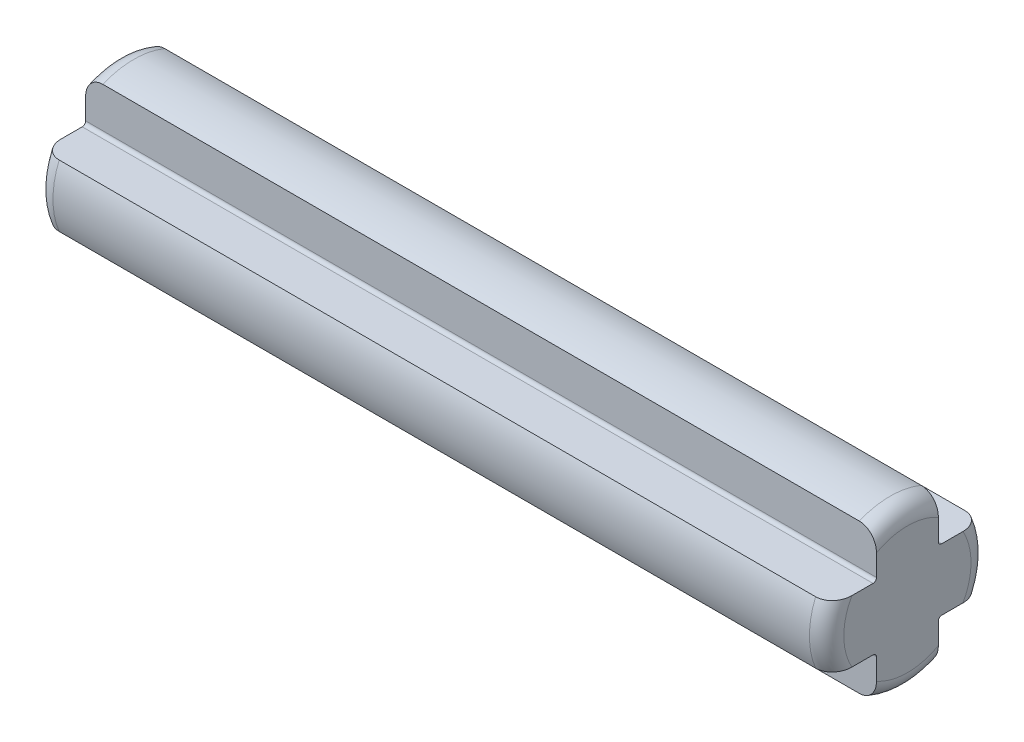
ISO-10303-21;
HEADER;
FILE_DESCRIPTION(('STEP AP214'),'2;1');
FILE_NAME('part.step','',(''),(''),'','','');
FILE_SCHEMA(('AUTOMOTIVE_DESIGN { 1 0 10303 214 1 1 1 1 }'));
ENDSEC;
DATA;
#1=APPLICATION_CONTEXT('core data for automotive mechanical design processes');
#2=APPLICATION_PROTOCOL_DEFINITION('international standard','automotive_design',2000,#1);
#3=PRODUCT_CONTEXT('',#1,'mechanical');
#4=PRODUCT('Part','Part','',(#3));
#5=PRODUCT_RELATED_PRODUCT_CATEGORY('part','',(#4));
#6=PRODUCT_DEFINITION_FORMATION('','',#4);
#7=PRODUCT_DEFINITION_CONTEXT('part definition',#1,'design');
#8=PRODUCT_DEFINITION('design','',#6,#7);
#9=PRODUCT_DEFINITION_SHAPE('','',#8);
#10=(LENGTH_UNIT() NAMED_UNIT(*) SI_UNIT(.MILLI.,.METRE.));
#11=(NAMED_UNIT(*) PLANE_ANGLE_UNIT() SI_UNIT($,.RADIAN.));
#12=(NAMED_UNIT(*) SI_UNIT($,.STERADIAN.) SOLID_ANGLE_UNIT());
#13=UNCERTAINTY_MEASURE_WITH_UNIT(LENGTH_MEASURE(1.E-05),#10,'distance_accuracy_value','');
#14=(GEOMETRIC_REPRESENTATION_CONTEXT(3) GLOBAL_UNCERTAINTY_ASSIGNED_CONTEXT((#13)) GLOBAL_UNIT_ASSIGNED_CONTEXT((#10,
#11,#12)) REPRESENTATION_CONTEXT('',''));
#15=CARTESIAN_POINT('',(0.,0.,0.));
#16=DIRECTION('',(0.,0.,1.));
#17=DIRECTION('',(1.,0.,0.));
#18=AXIS2_PLACEMENT_3D('',#15,#16,#17);
#19=CARTESIAN_POINT('',(11.5,0.,0.));
#20=DIRECTION('',(-1.,0.,0.));
#21=DIRECTION('',(0.,0.,1.));
#22=AXIS2_PLACEMENT_3D('',#19,#20,#21);
#23=CYLINDRICAL_SURFACE('',#22,2.35);
#24=DIRECTION('',(-1.,0.,0.));
#25=VECTOR('',#24,1.);
#26=CARTESIAN_POINT('',(11.5,0.9,2.17082933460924));
#27=LINE('',#26,#25);
#28=CARTESIAN_POINT('',(11.,0.9,2.17082933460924));
#29=VERTEX_POINT('',#28);
#30=CARTESIAN_POINT('',(-11.,0.9,2.17082933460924));
#31=VERTEX_POINT('',#30);
#32=EDGE_CURVE('E250',#29,#31,#27,.T.);
#33=ORIENTED_EDGE('',*,*,#32,.T.);
#34=CARTESIAN_POINT('',(-11.,0.,0.));
#35=DIRECTION('',(1.,0.,0.));
#36=DIRECTION('',(0.,0.,-1.));
#37=AXIS2_PLACEMENT_3D('',#34,#35,#36);
#38=CIRCLE('',#37,2.35);
#39=CARTESIAN_POINT('',(-11.,-0.900000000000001,2.17082933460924));
#40=VERTEX_POINT('',#39);
#41=EDGE_CURVE('E515',#31,#40,#38,.T.);
#42=ORIENTED_EDGE('',*,*,#41,.T.);
#43=DIRECTION('',(-1.,0.,0.));
#44=VECTOR('',#43,1.);
#45=CARTESIAN_POINT('',(11.5,-0.900000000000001,2.17082933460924));
#46=LINE('',#45,#44);
#47=CARTESIAN_POINT('',(11.,-0.900000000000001,2.17082933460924));
#48=VERTEX_POINT('',#47);
#49=EDGE_CURVE('E221',#48,#40,#46,.T.);
#50=ORIENTED_EDGE('',*,*,#49,.F.);
#51=CARTESIAN_POINT('',(11.,0.,0.));
#52=DIRECTION('',(1.,0.,0.));
#53=DIRECTION('',(0.,0.,-1.));
#54=AXIS2_PLACEMENT_3D('',#51,#52,#53);
#55=CIRCLE('',#54,2.35);
#56=EDGE_CURVE('E370',#48,#29,#55,.F.);
#57=ORIENTED_EDGE('',*,*,#56,.T.);
#58=EDGE_LOOP('',(#33,#42,#50,#57));
#59=FACE_BOUND('',#58,.T.);
#60=ADVANCED_FACE('F37',(#59),#23,.T.);
#61=CARTESIAN_POINT('',(11.5,-0.900000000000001,2.17082933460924));
#62=DIRECTION('',(0.,1.,0.));
#63=DIRECTION('',(0.,0.,1.));
#64=AXIS2_PLACEMENT_3D('',#61,#62,#63);
#65=PLANE('',#64);
#66=ORIENTED_EDGE('',*,*,#49,.T.);
#67=CARTESIAN_POINT('',(-11.,-0.900000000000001,2.17082933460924));
#68=CARTESIAN_POINT('',(-11.0264833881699,-0.900000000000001,2.17085986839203));
#69=CARTESIAN_POINT('',(-11.0529498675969,-0.900000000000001,2.16855372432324));
#70=CARTESIAN_POINT('',(-11.1050453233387,-0.900000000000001,2.15950506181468));
#71=CARTESIAN_POINT('',(-11.1306762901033,-0.900000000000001,2.15277404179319));
#72=CARTESIAN_POINT('',(-11.1804387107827,-0.900000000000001,2.1351114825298));
#73=CARTESIAN_POINT('',(-11.2045703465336,-0.900000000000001,2.12418045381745));
#74=CARTESIAN_POINT('',(-11.2507251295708,-0.900000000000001,2.09852306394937));
#75=CARTESIAN_POINT('',(-11.2727475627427,-0.900000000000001,2.0837954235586));
#76=CARTESIAN_POINT('',(-11.3147234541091,-0.900000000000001,2.05060839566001));
#77=CARTESIAN_POINT('',(-11.3346070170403,-0.900000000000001,2.03206082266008));
#78=CARTESIAN_POINT('',(-11.3712243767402,-0.900000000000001,1.99209288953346));
#79=CARTESIAN_POINT('',(-11.3879579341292,-0.900000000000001,1.97067231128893));
#80=CARTESIAN_POINT('',(-11.4190973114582,-0.900000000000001,1.92396602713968));
#81=CARTESIAN_POINT('',(-11.4332527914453,-0.900000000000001,1.89851375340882));
#82=CARTESIAN_POINT('',(-11.4575247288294,-0.900000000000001,1.84573102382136));
#83=CARTESIAN_POINT('',(-11.4676367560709,-0.900000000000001,1.81839854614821));
#84=CARTESIAN_POINT('',(-11.4838866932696,-0.900000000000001,1.76219756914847));
#85=CARTESIAN_POINT('',(-11.4899702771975,-0.900000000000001,1.73331353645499));
#86=CARTESIAN_POINT('',(-11.4980270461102,-0.900000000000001,1.67505065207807));
#87=CARTESIAN_POINT('',(-11.5000109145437,-0.900000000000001,1.64567328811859));
#88=CARTESIAN_POINT('',(-11.5,-0.900000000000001,1.61632298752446));
#89=B_SPLINE_CURVE_WITH_KNOTS('',3,(#67,#68,#69,#70,#71,#72,#73,#74,#75,#76,#77,#78,#79,#80,#81,
#82,#83,#84,#85,#86,#87,#88),.UNSPECIFIED.,.F.,.F.,(4,2,2,2,2,2,2,2,2,2,4),(0.,
0.0793238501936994,0.158442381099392,0.237551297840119,0.316686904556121,0.397909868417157,
0.479139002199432,0.566147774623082,0.653251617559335,0.741507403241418,0.829532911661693),.UNSPECIFIED.);
#90=CARTESIAN_POINT('',(-11.5,-0.900000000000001,1.61632298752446));
#91=VERTEX_POINT('',#90);
#92=EDGE_CURVE('E390',#40,#91,#89,.T.);
#93=ORIENTED_EDGE('',*,*,#92,.T.);
#94=DIRECTION('',(0.,0.,-1.));
#95=VECTOR('',#94,1.);
#96=CARTESIAN_POINT('',(-11.5,-0.900000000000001,2.17082933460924));
#97=LINE('',#96,#95);
#98=CARTESIAN_POINT('',(-11.5,-0.900000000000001,0.999999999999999));
#99=VERTEX_POINT('',#98);
#100=EDGE_CURVE('E218',#91,#99,#97,.T.);
#101=ORIENTED_EDGE('',*,*,#100,.T.);
#102=DIRECTION('',(-1.,0.,0.));
#103=VECTOR('',#102,1.);
#104=CARTESIAN_POINT('',(11.5,-0.900000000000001,0.999999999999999));
#105=LINE('',#104,#103);
#106=CARTESIAN_POINT('',(11.5,-0.900000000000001,0.999999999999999));
#107=VERTEX_POINT('',#106);
#108=EDGE_CURVE('E214',#107,#99,#105,.T.);
#109=ORIENTED_EDGE('',*,*,#108,.F.);
#110=DIRECTION('',(0.,0.,-1.));
#111=VECTOR('',#110,1.);
#112=CARTESIAN_POINT('',(11.5,-0.900000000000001,2.17082933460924));
#113=LINE('',#112,#111);
#114=CARTESIAN_POINT('',(11.5,-0.900000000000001,1.61632298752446));
#115=VERTEX_POINT('',#114);
#116=EDGE_CURVE('E201',#115,#107,#113,.T.);
#117=ORIENTED_EDGE('',*,*,#116,.F.);
#118=CARTESIAN_POINT('',(11.5,-0.900000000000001,1.61632298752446));
#119=CARTESIAN_POINT('',(11.5000222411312,-0.900000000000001,1.65066661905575));
#120=CARTESIAN_POINT('',(11.4972983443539,-0.900000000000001,1.68506058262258));
#121=CARTESIAN_POINT('',(11.4862156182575,-0.900000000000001,1.75308687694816));
#122=CARTESIAN_POINT('',(11.4778303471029,-0.900000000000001,1.78671486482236));
#123=CARTESIAN_POINT('',(11.4552419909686,-0.900000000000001,1.85211366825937));
#124=CARTESIAN_POINT('',(11.4410195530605,-0.900000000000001,1.88387790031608));
#125=CARTESIAN_POINT('',(11.4069131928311,-0.900000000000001,1.94414749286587));
#126=CARTESIAN_POINT('',(11.3870416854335,-0.900000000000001,1.97265980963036));
#127=CARTESIAN_POINT('',(11.344222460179,-0.900000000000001,2.02268935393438));
#128=CARTESIAN_POINT('',(11.3217526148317,-0.900000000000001,2.04461521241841));
#129=CARTESIAN_POINT('',(11.2730890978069,-0.900000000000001,2.08389547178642));
#130=CARTESIAN_POINT('',(11.2468952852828,-0.900000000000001,2.10124969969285));
#131=CARTESIAN_POINT('',(11.1943438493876,-0.900000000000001,2.12912089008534));
#132=CARTESIAN_POINT('',(11.1682509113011,-0.900000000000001,2.14013932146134));
#133=CARTESIAN_POINT('',(11.1145341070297,-0.900000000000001,2.15730052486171));
#134=CARTESIAN_POINT('',(11.086913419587,-0.900000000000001,2.1634530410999));
#135=CARTESIAN_POINT('',(11.0492135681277,-0.900000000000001,2.16830749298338));
#136=CARTESIAN_POINT('',(11.0393866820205,-0.900000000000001,2.1692533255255));
#137=CARTESIAN_POINT('',(11.0197081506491,-0.900000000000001,2.17051341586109));
#138=CARTESIAN_POINT('',(11.0098565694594,-0.900000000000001,2.17082867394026));
#139=CARTESIAN_POINT('',(11.,-0.900000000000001,2.17082933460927));
#140=B_SPLINE_CURVE_WITH_KNOTS('',3,(#118,#119,#120,#121,#122,#123,#124,#125,#126,#127,#128,
#129,#130,#131,#132,#133,#134,#135,#136,#137,#138,#139),.UNSPECIFIED.,.F.,.F.,(4,2,2,2,2,2,2,2,
2,2,4),(0.,0.103000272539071,0.206484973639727,0.310315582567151,0.413919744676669,
0.507586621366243,0.601257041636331,0.685799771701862,0.770172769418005,0.799774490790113,
0.829329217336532),.UNSPECIFIED.);
#141=EDGE_CURVE('E520',#115,#48,#140,.T.);
#142=ORIENTED_EDGE('',*,*,#141,.T.);
#143=EDGE_LOOP('',(#66,#93,#101,#109,#117,#142));
#144=FACE_BOUND('',#143,.T.);
#145=ADVANCED_FACE('F216',(#144),#65,.F.);
#146=CARTESIAN_POINT('',(11.5,-1.,0.999999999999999));
#147=DIRECTION('',(-1.,0.,0.));
#148=DIRECTION('',(0.,0.,1.));
#149=AXIS2_PLACEMENT_3D('',#146,#147,#148);
#150=CYLINDRICAL_SURFACE('',#149,0.0999999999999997);
#151=CARTESIAN_POINT('',(-11.5,-1.,0.999999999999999));
#152=DIRECTION('',(-1.,0.,0.));
#153=DIRECTION('',(0.,0.,1.));
#154=AXIS2_PLACEMENT_3D('',#151,#152,#153);
#155=CIRCLE('',#154,0.0999999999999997);
#156=CARTESIAN_POINT('',(-11.5,-1.,0.899999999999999));
#157=VERTEX_POINT('',#156);
#158=EDGE_CURVE('E252',#99,#157,#155,.T.);
#159=ORIENTED_EDGE('',*,*,#158,.T.);
#160=DIRECTION('',(-1.,0.,0.));
#161=VECTOR('',#160,1.);
#162=CARTESIAN_POINT('',(11.5,-1.,0.899999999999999));
#163=LINE('',#162,#161);
#164=CARTESIAN_POINT('',(11.5,-1.,0.899999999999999));
#165=VERTEX_POINT('',#164);
#166=EDGE_CURVE('E222',#165,#157,#163,.T.);
#167=ORIENTED_EDGE('',*,*,#166,.F.);
#168=CARTESIAN_POINT('',(11.5,-1.,0.999999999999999));
#169=DIRECTION('',(-1.,0.,0.));
#170=DIRECTION('',(0.,0.,1.));
#171=AXIS2_PLACEMENT_3D('',#168,#169,#170);
#172=CIRCLE('',#171,0.0999999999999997);
#173=EDGE_CURVE('E207',#107,#165,#172,.T.);
#174=ORIENTED_EDGE('',*,*,#173,.F.);
#175=ORIENTED_EDGE('',*,*,#108,.T.);
#176=EDGE_LOOP('',(#159,#167,#174,#175));
#177=FACE_BOUND('',#176,.T.);
#178=ADVANCED_FACE('F224',(#177),#150,.F.);
#179=CARTESIAN_POINT('',(11.5,-2.17082933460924,0.899999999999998));
#180=DIRECTION('',(0.,0.,-1.));
#181=DIRECTION('',(0.,1.,0.));
#182=AXIS2_PLACEMENT_3D('',#179,#180,#181);
#183=PLANE('',#182);
#184=DIRECTION('',(0.,-1.,0.));
#185=VECTOR('',#184,1.);
#186=CARTESIAN_POINT('',(-11.5,-2.17082933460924,0.899999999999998));
#187=LINE('',#186,#185);
#188=CARTESIAN_POINT('',(-11.5,-1.61632298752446,0.899999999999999));
#189=VERTEX_POINT('',#188);
#190=EDGE_CURVE('E254',#157,#189,#187,.T.);
#191=ORIENTED_EDGE('',*,*,#190,.T.);
#192=CARTESIAN_POINT('',(-11.5,-1.61632298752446,0.899999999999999));
#193=CARTESIAN_POINT('',(-11.5000222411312,-1.65066661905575,0.899999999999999));
#194=CARTESIAN_POINT('',(-11.4972983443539,-1.68506058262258,0.899999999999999));
#195=CARTESIAN_POINT('',(-11.4862156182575,-1.75308687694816,0.899999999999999));
#196=CARTESIAN_POINT('',(-11.4778303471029,-1.78671486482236,0.899999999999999));
#197=CARTESIAN_POINT('',(-11.4552419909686,-1.85211366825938,0.899999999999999));
#198=CARTESIAN_POINT('',(-11.4410195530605,-1.88387790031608,0.899999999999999));
#199=CARTESIAN_POINT('',(-11.4069131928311,-1.94414749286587,0.899999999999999));
#200=CARTESIAN_POINT('',(-11.3870416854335,-1.97265980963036,0.899999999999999));
#201=CARTESIAN_POINT('',(-11.344222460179,-2.02268935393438,0.899999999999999));
#202=CARTESIAN_POINT('',(-11.3217526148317,-2.04461521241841,0.899999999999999));
#203=CARTESIAN_POINT('',(-11.2730890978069,-2.08389547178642,0.899999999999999));
#204=CARTESIAN_POINT('',(-11.2468952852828,-2.10124969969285,0.899999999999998));
#205=CARTESIAN_POINT('',(-11.1943438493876,-2.12912089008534,0.899999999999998));
#206=CARTESIAN_POINT('',(-11.1682509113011,-2.14013932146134,0.899999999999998));
#207=CARTESIAN_POINT('',(-11.1145341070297,-2.15730052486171,0.899999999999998));
#208=CARTESIAN_POINT('',(-11.086913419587,-2.1634530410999,0.899999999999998));
#209=CARTESIAN_POINT('',(-11.0492135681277,-2.16830749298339,0.899999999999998));
#210=CARTESIAN_POINT('',(-11.0393866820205,-2.1692533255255,0.899999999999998));
#211=CARTESIAN_POINT('',(-11.0197081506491,-2.17051341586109,0.899999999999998));
#212=CARTESIAN_POINT('',(-11.0098565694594,-2.17082867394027,0.899999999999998));
#213=CARTESIAN_POINT('',(-11.,-2.17082933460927,0.899999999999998));
#214=B_SPLINE_CURVE_WITH_KNOTS('',3,(#192,#193,#194,#195,#196,#197,#198,#199,#200,#201,#202,
#203,#204,#205,#206,#207,#208,#209,#210,#211,#212,#213),.UNSPECIFIED.,.F.,.F.,(4,2,2,2,2,2,2,2,
2,2,4),(0.,0.103000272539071,0.206484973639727,0.310315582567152,0.413919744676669,
0.507586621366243,0.60125704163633,0.68579977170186,0.770172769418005,0.799774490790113,
0.829329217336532),.UNSPECIFIED.);
#215=CARTESIAN_POINT('',(-11.,-2.17082933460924,0.899999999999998));
#216=VERTEX_POINT('',#215);
#217=EDGE_CURVE('E365',#189,#216,#214,.T.);
#218=ORIENTED_EDGE('',*,*,#217,.T.);
#219=DIRECTION('',(-1.,0.,0.));
#220=VECTOR('',#219,1.);
#221=CARTESIAN_POINT('',(11.5,-2.17082933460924,0.899999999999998));
#222=LINE('',#221,#220);
#223=CARTESIAN_POINT('',(11.,-2.17082933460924,0.899999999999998));
#224=VERTEX_POINT('',#223);
#225=EDGE_CURVE('E312',#224,#216,#222,.T.);
#226=ORIENTED_EDGE('',*,*,#225,.F.);
#227=CARTESIAN_POINT('',(11.,-2.17082933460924,0.899999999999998));
#228=CARTESIAN_POINT('',(11.0264833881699,-2.17085986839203,0.899999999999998));
#229=CARTESIAN_POINT('',(11.0529498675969,-2.16855372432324,0.899999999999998));
#230=CARTESIAN_POINT('',(11.1050453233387,-2.15950506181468,0.899999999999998));
#231=CARTESIAN_POINT('',(11.1306762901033,-2.15277404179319,0.899999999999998));
#232=CARTESIAN_POINT('',(11.1804387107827,-2.1351114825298,0.899999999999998));
#233=CARTESIAN_POINT('',(11.2045703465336,-2.12418045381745,0.899999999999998));
#234=CARTESIAN_POINT('',(11.2507251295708,-2.09852306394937,0.899999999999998));
#235=CARTESIAN_POINT('',(11.2727475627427,-2.0837954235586,0.899999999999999));
#236=CARTESIAN_POINT('',(11.3147234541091,-2.05060839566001,0.899999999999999));
#237=CARTESIAN_POINT('',(11.3346070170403,-2.03206082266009,0.899999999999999));
#238=CARTESIAN_POINT('',(11.3712243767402,-1.99209288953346,0.899999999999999));
#239=CARTESIAN_POINT('',(11.3879579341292,-1.97067231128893,0.899999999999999));
#240=CARTESIAN_POINT('',(11.4190973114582,-1.92396602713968,0.899999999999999));
#241=CARTESIAN_POINT('',(11.4332527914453,-1.89851375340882,0.899999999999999));
#242=CARTESIAN_POINT('',(11.4575247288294,-1.84573102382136,0.899999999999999));
#243=CARTESIAN_POINT('',(11.4676367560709,-1.81839854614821,0.899999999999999));
#244=CARTESIAN_POINT('',(11.4838866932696,-1.76219756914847,0.899999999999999));
#245=CARTESIAN_POINT('',(11.4899702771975,-1.733313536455,0.899999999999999));
#246=CARTESIAN_POINT('',(11.4980270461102,-1.67505065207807,0.899999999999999));
#247=CARTESIAN_POINT('',(11.5000109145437,-1.64567328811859,0.899999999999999));
#248=CARTESIAN_POINT('',(11.5,-1.61632298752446,0.899999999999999));
#249=B_SPLINE_CURVE_WITH_KNOTS('',3,(#227,#228,#229,#230,#231,#232,#233,#234,#235,#236,#237,
#238,#239,#240,#241,#242,#243,#244,#245,#246,#247,#248),.UNSPECIFIED.,.F.,.F.,(4,2,2,2,2,2,2,2,
2,2,4),(0.,0.0793238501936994,0.158442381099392,0.237551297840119,0.316686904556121,
0.397909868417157,0.479139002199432,0.566147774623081,0.653251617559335,0.741507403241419,
0.829532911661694),.UNSPECIFIED.);
#250=CARTESIAN_POINT('',(11.5,-1.61632298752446,0.899999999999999));
#251=VERTEX_POINT('',#250);
#252=EDGE_CURVE('E359',#224,#251,#249,.T.);
#253=ORIENTED_EDGE('',*,*,#252,.T.);
#254=DIRECTION('',(0.,-1.,0.));
#255=VECTOR('',#254,1.);
#256=CARTESIAN_POINT('',(11.5,-2.17082933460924,0.899999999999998));
#257=LINE('',#256,#255);
#258=EDGE_CURVE('E227',#165,#251,#257,.T.);
#259=ORIENTED_EDGE('',*,*,#258,.F.);
#260=ORIENTED_EDGE('',*,*,#166,.T.);
#261=EDGE_LOOP('',(#191,#218,#226,#253,#259,#260));
#262=FACE_BOUND('',#261,.T.);
#263=ADVANCED_FACE('F350',(#262),#183,.F.);
#264=CARTESIAN_POINT('',(11.5,0.,0.));
#265=DIRECTION('',(-1.,0.,0.));
#266=DIRECTION('',(0.,0.,1.));
#267=AXIS2_PLACEMENT_3D('',#264,#265,#266);
#268=CYLINDRICAL_SURFACE('',#267,2.35);
#269=ORIENTED_EDGE('',*,*,#225,.T.);
#270=CARTESIAN_POINT('',(-11.,0.,0.));
#271=DIRECTION('',(1.,0.,0.));
#272=DIRECTION('',(0.,0.,-1.));
#273=AXIS2_PLACEMENT_3D('',#270,#271,#272);
#274=CIRCLE('',#273,2.35);
#275=CARTESIAN_POINT('',(-11.,-2.17082933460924,-0.9));
#276=VERTEX_POINT('',#275);
#277=EDGE_CURVE('E319',#216,#276,#274,.T.);
#278=ORIENTED_EDGE('',*,*,#277,.T.);
#279=DIRECTION('',(-1.,0.,0.));
#280=VECTOR('',#279,1.);
#281=CARTESIAN_POINT('',(11.5,-2.17082933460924,-0.9));
#282=LINE('',#281,#280);
#283=CARTESIAN_POINT('',(11.,-2.17082933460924,-0.9));
#284=VERTEX_POINT('',#283);
#285=EDGE_CURVE('E309',#284,#276,#282,.T.);
#286=ORIENTED_EDGE('',*,*,#285,.F.);
#287=CARTESIAN_POINT('',(11.,0.,0.));
#288=DIRECTION('',(1.,0.,0.));
#289=DIRECTION('',(0.,0.,-1.));
#290=AXIS2_PLACEMENT_3D('',#287,#288,#289);
#291=CIRCLE('',#290,2.35);
#292=EDGE_CURVE('E317',#284,#224,#291,.F.);
#293=ORIENTED_EDGE('',*,*,#292,.T.);
#294=EDGE_LOOP('',(#269,#278,#286,#293));
#295=FACE_BOUND('',#294,.T.);
#296=ADVANCED_FACE('F344',(#295),#268,.T.);
#297=CARTESIAN_POINT('',(11.5,-2.17082933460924,-0.9));
#298=DIRECTION('',(0.,0.,1.));
#299=DIRECTION('',(0.,-1.,0.));
#300=AXIS2_PLACEMENT_3D('',#297,#298,#299);
#301=PLANE('',#300);
#302=ORIENTED_EDGE('',*,*,#285,.T.);
#303=CARTESIAN_POINT('',(-11.,-2.17082933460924,-0.9));
#304=CARTESIAN_POINT('',(-11.0264833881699,-2.17085986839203,-0.9));
#305=CARTESIAN_POINT('',(-11.0529498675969,-2.16855372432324,-0.9));
#306=CARTESIAN_POINT('',(-11.1050453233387,-2.15950506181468,-0.9));
#307=CARTESIAN_POINT('',(-11.1306762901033,-2.15277404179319,-0.9));
#308=CARTESIAN_POINT('',(-11.1804387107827,-2.1351114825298,-0.9));
#309=CARTESIAN_POINT('',(-11.2045703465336,-2.12418045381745,-0.9));
#310=CARTESIAN_POINT('',(-11.2507251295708,-2.09852306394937,-0.9));
#311=CARTESIAN_POINT('',(-11.2727475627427,-2.0837954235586,-0.9));
#312=CARTESIAN_POINT('',(-11.3147234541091,-2.05060839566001,-0.9));
#313=CARTESIAN_POINT('',(-11.3346070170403,-2.03206082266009,-0.9));
#314=CARTESIAN_POINT('',(-11.3712243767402,-1.99209288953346,-0.9));
#315=CARTESIAN_POINT('',(-11.3879579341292,-1.97067231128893,-0.9));
#316=CARTESIAN_POINT('',(-11.4190973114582,-1.92396602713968,-0.9));
#317=CARTESIAN_POINT('',(-11.4332527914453,-1.89851375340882,-0.9));
#318=CARTESIAN_POINT('',(-11.4575247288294,-1.84573102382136,-0.9));
#319=CARTESIAN_POINT('',(-11.4676367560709,-1.81839854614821,-0.9));
#320=CARTESIAN_POINT('',(-11.4838866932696,-1.76219756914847,-0.9));
#321=CARTESIAN_POINT('',(-11.4899702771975,-1.733313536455,-0.9));
#322=CARTESIAN_POINT('',(-11.4980270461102,-1.67505065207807,-0.9));
#323=CARTESIAN_POINT('',(-11.5000109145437,-1.64567328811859,-0.9));
#324=CARTESIAN_POINT('',(-11.5,-1.61632298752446,-0.9));
#325=B_SPLINE_CURVE_WITH_KNOTS('',3,(#303,#304,#305,#306,#307,#308,#309,#310,#311,#312,#313,
#314,#315,#316,#317,#318,#319,#320,#321,#322,#323,#324),.UNSPECIFIED.,.F.,.F.,(4,2,2,2,2,2,2,2,
2,2,4),(0.,0.0793238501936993,0.158442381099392,0.237551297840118,0.316686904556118,
0.397909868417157,0.479139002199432,0.566147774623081,0.653251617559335,0.741507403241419,
0.829532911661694),.UNSPECIFIED.);
#326=CARTESIAN_POINT('',(-11.5,-1.61632298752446,-0.9));
#327=VERTEX_POINT('',#326);
#328=EDGE_CURVE('E329',#276,#327,#325,.T.);
#329=ORIENTED_EDGE('',*,*,#328,.T.);
#330=DIRECTION('',(0.,1.,0.));
#331=VECTOR('',#330,1.);
#332=CARTESIAN_POINT('',(-11.5,-2.17082933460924,-0.9));
#333=LINE('',#332,#331);
#334=CARTESIAN_POINT('',(-11.5,-1.,-0.9));
#335=VERTEX_POINT('',#334);
#336=EDGE_CURVE('E257',#327,#335,#333,.T.);
#337=ORIENTED_EDGE('',*,*,#336,.T.);
#338=DIRECTION('',(-1.,0.,0.));
#339=VECTOR('',#338,1.);
#340=CARTESIAN_POINT('',(11.5,-1.,-0.9));
#341=LINE('',#340,#339);
#342=CARTESIAN_POINT('',(11.5,-1.,-0.9));
#343=VERTEX_POINT('',#342);
#344=EDGE_CURVE('E306',#343,#335,#341,.T.);
#345=ORIENTED_EDGE('',*,*,#344,.F.);
#346=DIRECTION('',(0.,1.,0.));
#347=VECTOR('',#346,1.);
#348=CARTESIAN_POINT('',(11.5,-2.17082933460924,-0.9));
#349=LINE('',#348,#347);
#350=CARTESIAN_POINT('',(11.5,-1.61632298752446,-0.9));
#351=VERTEX_POINT('',#350);
#352=EDGE_CURVE('E229',#351,#343,#349,.T.);
#353=ORIENTED_EDGE('',*,*,#352,.F.);
#354=CARTESIAN_POINT('',(11.5,-1.61632298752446,-0.9));
#355=CARTESIAN_POINT('',(11.5000222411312,-1.65066661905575,-0.9));
#356=CARTESIAN_POINT('',(11.4972983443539,-1.68506058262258,-0.9));
#357=CARTESIAN_POINT('',(11.4862156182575,-1.75308687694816,-0.9));
#358=CARTESIAN_POINT('',(11.4778303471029,-1.78671486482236,-0.9));
#359=CARTESIAN_POINT('',(11.4552419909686,-1.85211366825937,-0.9));
#360=CARTESIAN_POINT('',(11.4410195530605,-1.88387790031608,-0.9));
#361=CARTESIAN_POINT('',(11.4069131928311,-1.94414749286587,-0.9));
#362=CARTESIAN_POINT('',(11.3870416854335,-1.97265980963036,-0.9));
#363=CARTESIAN_POINT('',(11.344222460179,-2.02268935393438,-0.9));
#364=CARTESIAN_POINT('',(11.3217526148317,-2.04461521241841,-0.9));
#365=CARTESIAN_POINT('',(11.2730890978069,-2.08389547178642,-0.9));
#366=CARTESIAN_POINT('',(11.2468952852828,-2.10124969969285,-0.9));
#367=CARTESIAN_POINT('',(11.1943438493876,-2.12912089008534,-0.9));
#368=CARTESIAN_POINT('',(11.1682509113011,-2.14013932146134,-0.9));
#369=CARTESIAN_POINT('',(11.1145341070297,-2.15730052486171,-0.9));
#370=CARTESIAN_POINT('',(11.086913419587,-2.1634530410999,-0.9));
#371=CARTESIAN_POINT('',(11.0492135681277,-2.16830749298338,-0.9));
#372=CARTESIAN_POINT('',(11.0393866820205,-2.1692533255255,-0.9));
#373=CARTESIAN_POINT('',(11.0197081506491,-2.17051341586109,-0.9));
#374=CARTESIAN_POINT('',(11.0098565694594,-2.17082867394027,-0.9));
#375=CARTESIAN_POINT('',(11.,-2.17082933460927,-0.9));
#376=B_SPLINE_CURVE_WITH_KNOTS('',3,(#354,#355,#356,#357,#358,#359,#360,#361,#362,#363,#364,
#365,#366,#367,#368,#369,#370,#371,#372,#373,#374,#375),.UNSPECIFIED.,.F.,.F.,(4,2,2,2,2,2,2,2,
2,2,4),(0.,0.103000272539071,0.206484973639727,0.310315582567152,0.413919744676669,
0.507586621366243,0.601257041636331,0.685799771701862,0.770172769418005,0.799774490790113,
0.829329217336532),.UNSPECIFIED.);
#377=EDGE_CURVE('E322',#351,#284,#376,.T.);
#378=ORIENTED_EDGE('',*,*,#377,.T.);
#379=EDGE_LOOP('',(#302,#329,#337,#345,#353,#378));
#380=FACE_BOUND('',#379,.T.);
#381=ADVANCED_FACE('F338',(#380),#301,.F.);
#382=CARTESIAN_POINT('',(11.5,-1.,-1.));
#383=DIRECTION('',(-1.,0.,0.));
#384=DIRECTION('',(0.,0.,1.));
#385=AXIS2_PLACEMENT_3D('',#382,#383,#384);
#386=CYLINDRICAL_SURFACE('',#385,0.0999999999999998);
#387=CARTESIAN_POINT('',(-11.5,-1.,-1.));
#388=DIRECTION('',(-1.,0.,0.));
#389=DIRECTION('',(0.,0.,-1.));
#390=AXIS2_PLACEMENT_3D('',#387,#388,#389);
#391=CIRCLE('',#390,0.0999999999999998);
#392=CARTESIAN_POINT('',(-11.5,-0.9,-1.));
#393=VERTEX_POINT('',#392);
#394=EDGE_CURVE('E259',#335,#393,#391,.T.);
#395=ORIENTED_EDGE('',*,*,#394,.T.);
#396=DIRECTION('',(-1.,0.,0.));
#397=VECTOR('',#396,1.);
#398=CARTESIAN_POINT('',(11.5,-0.9,-1.));
#399=LINE('',#398,#397);
#400=CARTESIAN_POINT('',(11.5,-0.9,-1.));
#401=VERTEX_POINT('',#400);
#402=EDGE_CURVE('E303',#401,#393,#399,.T.);
#403=ORIENTED_EDGE('',*,*,#402,.F.);
#404=CARTESIAN_POINT('',(11.5,-1.,-1.));
#405=DIRECTION('',(-1.,0.,0.));
#406=DIRECTION('',(0.,0.,-1.));
#407=AXIS2_PLACEMENT_3D('',#404,#405,#406);
#408=CIRCLE('',#407,0.0999999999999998);
#409=EDGE_CURVE('E233',#343,#401,#408,.T.);
#410=ORIENTED_EDGE('',*,*,#409,.F.);
#411=ORIENTED_EDGE('',*,*,#344,.T.);
#412=EDGE_LOOP('',(#395,#403,#410,#411));
#413=FACE_BOUND('',#412,.T.);
#414=ADVANCED_FACE('F343',(#413),#386,.F.);
#415=CARTESIAN_POINT('',(11.5,-0.900000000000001,-2.17082933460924));
#416=DIRECTION('',(0.,1.,0.));
#417=DIRECTION('',(0.,0.,1.));
#418=AXIS2_PLACEMENT_3D('',#415,#416,#417);
#419=PLANE('',#418);
#420=DIRECTION('',(0.,0.,-1.));
#421=VECTOR('',#420,1.);
#422=CARTESIAN_POINT('',(-11.5,-0.900000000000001,-2.17082933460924));
#423=LINE('',#422,#421);
#424=CARTESIAN_POINT('',(-11.5,-0.9,-1.61632298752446));
#425=VERTEX_POINT('',#424);
#426=EDGE_CURVE('E261',#393,#425,#423,.T.);
#427=ORIENTED_EDGE('',*,*,#426,.T.);
#428=CARTESIAN_POINT('',(-11.5,-0.9,-1.61632298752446));
#429=CARTESIAN_POINT('',(-11.5000222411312,-0.9,-1.65066661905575));
#430=CARTESIAN_POINT('',(-11.4972983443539,-0.9,-1.68506058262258));
#431=CARTESIAN_POINT('',(-11.4862156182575,-0.9,-1.75308687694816));
#432=CARTESIAN_POINT('',(-11.4778303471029,-0.9,-1.78671486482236));
#433=CARTESIAN_POINT('',(-11.4552419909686,-0.9,-1.85211366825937));
#434=CARTESIAN_POINT('',(-11.4410195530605,-0.9,-1.88387790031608));
#435=CARTESIAN_POINT('',(-11.4069131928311,-0.9,-1.94414749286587));
#436=CARTESIAN_POINT('',(-11.3870416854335,-0.9,-1.97265980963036));
#437=CARTESIAN_POINT('',(-11.344222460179,-0.9,-2.02268935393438));
#438=CARTESIAN_POINT('',(-11.3217526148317,-0.900000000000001,-2.04461521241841));
#439=CARTESIAN_POINT('',(-11.2730890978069,-0.900000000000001,-2.08389547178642));
#440=CARTESIAN_POINT('',(-11.2468952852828,-0.900000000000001,-2.10124969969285));
#441=CARTESIAN_POINT('',(-11.1943438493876,-0.900000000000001,-2.12912089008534));
#442=CARTESIAN_POINT('',(-11.1682509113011,-0.900000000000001,-2.14013932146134));
#443=CARTESIAN_POINT('',(-11.1145341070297,-0.900000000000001,-2.15730052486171));
#444=CARTESIAN_POINT('',(-11.086913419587,-0.900000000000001,-2.1634530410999));
#445=CARTESIAN_POINT('',(-11.0492135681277,-0.900000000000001,-2.16830749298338));
#446=CARTESIAN_POINT('',(-11.0393866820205,-0.900000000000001,-2.1692533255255));
#447=CARTESIAN_POINT('',(-11.0197081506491,-0.900000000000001,-2.17051341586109));
#448=CARTESIAN_POINT('',(-11.0098565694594,-0.900000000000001,-2.17082867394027));
#449=CARTESIAN_POINT('',(-11.,-0.900000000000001,-2.17082933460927));
#450=B_SPLINE_CURVE_WITH_KNOTS('',3,(#428,#429,#430,#431,#432,#433,#434,#435,#436,#437,#438,
#439,#440,#441,#442,#443,#444,#445,#446,#447,#448,#449),.UNSPECIFIED.,.F.,.F.,(4,2,2,2,2,2,2,2,
2,2,4),(0.,0.103000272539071,0.206484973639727,0.310315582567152,0.413919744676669,
0.507586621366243,0.601257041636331,0.685799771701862,0.770172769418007,0.799774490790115,
0.829329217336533),.UNSPECIFIED.);
#451=CARTESIAN_POINT('',(-11.,-0.9,-2.17082933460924));
#452=VERTEX_POINT('',#451);
#453=EDGE_CURVE('E489',#425,#452,#450,.T.);
#454=ORIENTED_EDGE('',*,*,#453,.T.);
#455=DIRECTION('',(-1.,0.,0.));
#456=VECTOR('',#455,1.);
#457=CARTESIAN_POINT('',(11.5,-0.9,-2.17082933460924));
#458=LINE('',#457,#456);
#459=CARTESIAN_POINT('',(11.,-0.9,-2.17082933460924));
#460=VERTEX_POINT('',#459);
#461=EDGE_CURVE('E300',#460,#452,#458,.T.);
#462=ORIENTED_EDGE('',*,*,#461,.F.);
#463=CARTESIAN_POINT('',(11.,-0.9,-2.17082933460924));
#464=CARTESIAN_POINT('',(11.0264833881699,-0.9,-2.17085986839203));
#465=CARTESIAN_POINT('',(11.0529498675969,-0.900000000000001,-2.16855372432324));
#466=CARTESIAN_POINT('',(11.1050453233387,-0.900000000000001,-2.15950506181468));
#467=CARTESIAN_POINT('',(11.1306762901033,-0.900000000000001,-2.15277404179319));
#468=CARTESIAN_POINT('',(11.1804387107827,-0.900000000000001,-2.1351114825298));
#469=CARTESIAN_POINT('',(11.2045703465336,-0.900000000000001,-2.12418045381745));
#470=CARTESIAN_POINT('',(11.2507251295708,-0.900000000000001,-2.09852306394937));
#471=CARTESIAN_POINT('',(11.2727475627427,-0.900000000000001,-2.0837954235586));
#472=CARTESIAN_POINT('',(11.3147234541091,-0.900000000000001,-2.05060839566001));
#473=CARTESIAN_POINT('',(11.3346070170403,-0.9,-2.03206082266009));
#474=CARTESIAN_POINT('',(11.3712243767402,-0.9,-1.99209288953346));
#475=CARTESIAN_POINT('',(11.3879579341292,-0.9,-1.97067231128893));
#476=CARTESIAN_POINT('',(11.4190973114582,-0.9,-1.92396602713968));
#477=CARTESIAN_POINT('',(11.4332527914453,-0.9,-1.89851375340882));
#478=CARTESIAN_POINT('',(11.4575247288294,-0.9,-1.84573102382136));
#479=CARTESIAN_POINT('',(11.4676367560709,-0.9,-1.81839854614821));
#480=CARTESIAN_POINT('',(11.4838866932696,-0.9,-1.76219756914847));
#481=CARTESIAN_POINT('',(11.4899702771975,-0.9,-1.733313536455));
#482=CARTESIAN_POINT('',(11.4980270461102,-0.9,-1.67505065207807));
#483=CARTESIAN_POINT('',(11.5000109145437,-0.9,-1.64567328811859));
#484=CARTESIAN_POINT('',(11.5,-0.9,-1.61632298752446));
#485=B_SPLINE_CURVE_WITH_KNOTS('',3,(#463,#464,#465,#466,#467,#468,#469,#470,#471,#472,#473,
#474,#475,#476,#477,#478,#479,#480,#481,#482,#483,#484),.UNSPECIFIED.,.F.,.F.,(4,2,2,2,2,2,2,2,
2,2,4),(0.,0.0793238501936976,0.158442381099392,0.237551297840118,0.316686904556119,
0.397909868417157,0.479139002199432,0.566147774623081,0.653251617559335,0.741507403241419,
0.829532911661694),.UNSPECIFIED.);
#486=CARTESIAN_POINT('',(11.5,-0.9,-1.61632298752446));
#487=VERTEX_POINT('',#486);
#488=EDGE_CURVE('E53',#460,#487,#485,.T.);
#489=ORIENTED_EDGE('',*,*,#488,.T.);
#490=DIRECTION('',(0.,0.,-1.));
#491=VECTOR('',#490,1.);
#492=CARTESIAN_POINT('',(11.5,-0.900000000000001,-2.17082933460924));
#493=LINE('',#492,#491);
#494=EDGE_CURVE('E235',#401,#487,#493,.T.);
#495=ORIENTED_EDGE('',*,*,#494,.F.);
#496=ORIENTED_EDGE('',*,*,#402,.T.);
#497=EDGE_LOOP('',(#427,#454,#462,#489,#495,#496));
#498=FACE_BOUND('',#497,.T.);
#499=ADVANCED_FACE('F496',(#498),#419,.F.);
#500=CARTESIAN_POINT('',(11.5,0.,0.));
#501=DIRECTION('',(-1.,0.,0.));
#502=DIRECTION('',(0.,0.,1.));
#503=AXIS2_PLACEMENT_3D('',#500,#501,#502);
#504=CYLINDRICAL_SURFACE('',#503,2.35);
#505=ORIENTED_EDGE('',*,*,#461,.T.);
#506=CARTESIAN_POINT('',(-11.,0.,0.));
#507=DIRECTION('',(1.,0.,0.));
#508=DIRECTION('',(0.,0.,-1.));
#509=AXIS2_PLACEMENT_3D('',#506,#507,#508);
#510=CIRCLE('',#509,2.35);
#511=CARTESIAN_POINT('',(-11.,0.900000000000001,-2.17082933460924));
#512=VERTEX_POINT('',#511);
#513=EDGE_CURVE('E575',#452,#512,#510,.T.);
#514=ORIENTED_EDGE('',*,*,#513,.T.);
#515=DIRECTION('',(-1.,0.,0.));
#516=VECTOR('',#515,1.);
#517=CARTESIAN_POINT('',(11.5,0.900000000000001,-2.17082933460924));
#518=LINE('',#517,#516);
#519=CARTESIAN_POINT('',(11.,0.900000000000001,-2.17082933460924));
#520=VERTEX_POINT('',#519);
#521=EDGE_CURVE('E297',#520,#512,#518,.T.);
#522=ORIENTED_EDGE('',*,*,#521,.F.);
#523=CARTESIAN_POINT('',(11.,0.,0.));
#524=DIRECTION('',(1.,0.,0.));
#525=DIRECTION('',(0.,0.,-1.));
#526=AXIS2_PLACEMENT_3D('',#523,#524,#525);
#527=CIRCLE('',#526,2.35);
#528=EDGE_CURVE('E574',#520,#460,#527,.F.);
#529=ORIENTED_EDGE('',*,*,#528,.T.);
#530=EDGE_LOOP('',(#505,#514,#522,#529));
#531=FACE_BOUND('',#530,.T.);
#532=ADVANCED_FACE('F464',(#531),#504,.T.);
#533=CARTESIAN_POINT('',(11.5,0.900000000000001,-2.17082933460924));
#534=DIRECTION('',(0.,-1.,0.));
#535=DIRECTION('',(0.,0.,-1.));
#536=AXIS2_PLACEMENT_3D('',#533,#534,#535);
#537=PLANE('',#536);
#538=ORIENTED_EDGE('',*,*,#521,.T.);
#539=CARTESIAN_POINT('',(-11.,0.900000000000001,-2.17082933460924));
#540=CARTESIAN_POINT('',(-11.0264833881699,0.900000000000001,-2.17085986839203));
#541=CARTESIAN_POINT('',(-11.0529498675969,0.900000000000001,-2.16855372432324));
#542=CARTESIAN_POINT('',(-11.1050453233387,0.900000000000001,-2.15950506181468));
#543=CARTESIAN_POINT('',(-11.1306762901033,0.900000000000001,-2.15277404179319));
#544=CARTESIAN_POINT('',(-11.1804387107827,0.900000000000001,-2.1351114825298));
#545=CARTESIAN_POINT('',(-11.2045703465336,0.900000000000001,-2.12418045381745));
#546=CARTESIAN_POINT('',(-11.2507251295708,0.900000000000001,-2.09852306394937));
#547=CARTESIAN_POINT('',(-11.2727475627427,0.900000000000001,-2.0837954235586));
#548=CARTESIAN_POINT('',(-11.3147234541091,0.900000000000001,-2.05060839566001));
#549=CARTESIAN_POINT('',(-11.3346070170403,0.9,-2.03206082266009));
#550=CARTESIAN_POINT('',(-11.3712243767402,0.9,-1.99209288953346));
#551=CARTESIAN_POINT('',(-11.3879579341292,0.9,-1.97067231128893));
#552=CARTESIAN_POINT('',(-11.4190973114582,0.9,-1.92396602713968));
#553=CARTESIAN_POINT('',(-11.4332527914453,0.9,-1.89851375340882));
#554=CARTESIAN_POINT('',(-11.4575247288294,0.9,-1.84573102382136));
#555=CARTESIAN_POINT('',(-11.4676367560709,0.9,-1.81839854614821));
#556=CARTESIAN_POINT('',(-11.4838866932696,0.9,-1.76219756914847));
#557=CARTESIAN_POINT('',(-11.4899702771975,0.9,-1.733313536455));
#558=CARTESIAN_POINT('',(-11.4980270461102,0.9,-1.67505065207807));
#559=CARTESIAN_POINT('',(-11.5000109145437,0.9,-1.64567328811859));
#560=CARTESIAN_POINT('',(-11.5,0.9,-1.61632298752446));
#561=B_SPLINE_CURVE_WITH_KNOTS('',3,(#539,#540,#541,#542,#543,#544,#545,#546,#547,#548,#549,
#550,#551,#552,#553,#554,#555,#556,#557,#558,#559,#560),.UNSPECIFIED.,.F.,.F.,(4,2,2,2,2,2,2,2,
2,2,4),(0.,0.0793238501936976,0.158442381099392,0.237551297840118,0.316686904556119,
0.397909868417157,0.479139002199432,0.566147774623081,0.653251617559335,0.741507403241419,
0.829532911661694),.UNSPECIFIED.);
#562=CARTESIAN_POINT('',(-11.5,0.9,-1.61632298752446));
#563=VERTEX_POINT('',#562);
#564=EDGE_CURVE('E473',#512,#563,#561,.T.);
#565=ORIENTED_EDGE('',*,*,#564,.T.);
#566=DIRECTION('',(0.,0.,1.));
#567=VECTOR('',#566,1.);
#568=CARTESIAN_POINT('',(-11.5,0.900000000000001,-2.17082933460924));
#569=LINE('',#568,#567);
#570=CARTESIAN_POINT('',(-11.5,0.9,-1.));
#571=VERTEX_POINT('',#570);
#572=EDGE_CURVE('E264',#563,#571,#569,.T.);
#573=ORIENTED_EDGE('',*,*,#572,.T.);
#574=DIRECTION('',(-1.,0.,0.));
#575=VECTOR('',#574,1.);
#576=CARTESIAN_POINT('',(11.5,0.9,-1.));
#577=LINE('',#576,#575);
#578=CARTESIAN_POINT('',(11.5,0.9,-1.));
#579=VERTEX_POINT('',#578);
#580=EDGE_CURVE('E294',#579,#571,#577,.T.);
#581=ORIENTED_EDGE('',*,*,#580,.F.);
#582=DIRECTION('',(0.,0.,1.));
#583=VECTOR('',#582,1.);
#584=CARTESIAN_POINT('',(11.5,0.900000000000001,-2.17082933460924));
#585=LINE('',#584,#583);
#586=CARTESIAN_POINT('',(11.5,0.9,-1.61632298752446));
#587=VERTEX_POINT('',#586);
#588=EDGE_CURVE('E237',#587,#579,#585,.T.);
#589=ORIENTED_EDGE('',*,*,#588,.F.);
#590=CARTESIAN_POINT('',(11.5,0.9,-1.61632298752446));
#591=CARTESIAN_POINT('',(11.5000222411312,0.9,-1.65066661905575));
#592=CARTESIAN_POINT('',(11.4972983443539,0.9,-1.68506058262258));
#593=CARTESIAN_POINT('',(11.4862156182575,0.9,-1.75308687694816));
#594=CARTESIAN_POINT('',(11.4778303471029,0.9,-1.78671486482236));
#595=CARTESIAN_POINT('',(11.4552419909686,0.9,-1.85211366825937));
#596=CARTESIAN_POINT('',(11.4410195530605,0.9,-1.88387790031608));
#597=CARTESIAN_POINT('',(11.4069131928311,0.9,-1.94414749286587));
#598=CARTESIAN_POINT('',(11.3870416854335,0.9,-1.97265980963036));
#599=CARTESIAN_POINT('',(11.344222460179,0.9,-2.02268935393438));
#600=CARTESIAN_POINT('',(11.3217526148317,0.900000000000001,-2.04461521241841));
#601=CARTESIAN_POINT('',(11.2730890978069,0.900000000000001,-2.08389547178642));
#602=CARTESIAN_POINT('',(11.2468952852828,0.900000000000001,-2.10124969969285));
#603=CARTESIAN_POINT('',(11.1943438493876,0.900000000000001,-2.12912089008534));
#604=CARTESIAN_POINT('',(11.1682509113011,0.900000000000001,-2.14013932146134));
#605=CARTESIAN_POINT('',(11.1145341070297,0.900000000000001,-2.15730052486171));
#606=CARTESIAN_POINT('',(11.086913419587,0.900000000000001,-2.1634530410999));
#607=CARTESIAN_POINT('',(11.0492135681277,0.900000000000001,-2.16830749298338));
#608=CARTESIAN_POINT('',(11.0393866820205,0.900000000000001,-2.1692533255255));
#609=CARTESIAN_POINT('',(11.0197081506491,0.900000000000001,-2.17051341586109));
#610=CARTESIAN_POINT('',(11.0098565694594,0.900000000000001,-2.17082867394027));
#611=CARTESIAN_POINT('',(11.,0.900000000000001,-2.17082933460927));
#612=B_SPLINE_CURVE_WITH_KNOTS('',3,(#590,#591,#592,#593,#594,#595,#596,#597,#598,#599,#600,
#601,#602,#603,#604,#605,#606,#607,#608,#609,#610,#611),.UNSPECIFIED.,.F.,.F.,(4,2,2,2,2,2,2,2,
2,2,4),(0.,0.103000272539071,0.206484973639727,0.310315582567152,0.413919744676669,
0.507586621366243,0.601257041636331,0.685799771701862,0.770172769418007,0.799774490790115,
0.829329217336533),.UNSPECIFIED.);
#613=EDGE_CURVE('E61',#587,#520,#612,.T.);
#614=ORIENTED_EDGE('',*,*,#613,.T.);
#615=EDGE_LOOP('',(#538,#565,#573,#581,#589,#614));
#616=FACE_BOUND('',#615,.T.);
#617=ADVANCED_FACE('F459',(#616),#537,.F.);
#618=CARTESIAN_POINT('',(11.5,1.,-1.));
#619=DIRECTION('',(-1.,0.,0.));
#620=DIRECTION('',(0.,0.,1.));
#621=AXIS2_PLACEMENT_3D('',#618,#619,#620);
#622=CYLINDRICAL_SURFACE('',#621,0.0999999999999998);
#623=CARTESIAN_POINT('',(-11.5,1.,-1.));
#624=DIRECTION('',(-1.,0.,0.));
#625=DIRECTION('',(0.,0.,1.));
#626=AXIS2_PLACEMENT_3D('',#623,#624,#625);
#627=CIRCLE('',#626,0.0999999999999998);
#628=CARTESIAN_POINT('',(-11.5,1.,-0.9));
#629=VERTEX_POINT('',#628);
#630=EDGE_CURVE('E266',#571,#629,#627,.T.);
#631=ORIENTED_EDGE('',*,*,#630,.T.);
#632=DIRECTION('',(-1.,0.,0.));
#633=VECTOR('',#632,1.);
#634=CARTESIAN_POINT('',(11.5,1.,-0.9));
#635=LINE('',#634,#633);
#636=CARTESIAN_POINT('',(11.5,1.,-0.9));
#637=VERTEX_POINT('',#636);
#638=EDGE_CURVE('E291',#637,#629,#635,.T.);
#639=ORIENTED_EDGE('',*,*,#638,.F.);
#640=CARTESIAN_POINT('',(11.5,1.,-1.));
#641=DIRECTION('',(-1.,0.,0.));
#642=DIRECTION('',(0.,0.,1.));
#643=AXIS2_PLACEMENT_3D('',#640,#641,#642);
#644=CIRCLE('',#643,0.0999999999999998);
#645=EDGE_CURVE('E239',#579,#637,#644,.T.);
#646=ORIENTED_EDGE('',*,*,#645,.F.);
#647=ORIENTED_EDGE('',*,*,#580,.T.);
#648=EDGE_LOOP('',(#631,#639,#646,#647));
#649=FACE_BOUND('',#648,.T.);
#650=ADVANCED_FACE('F454',(#649),#622,.F.);
#651=CARTESIAN_POINT('',(11.5,2.17082933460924,-0.9));
#652=DIRECTION('',(0.,0.,1.));
#653=DIRECTION('',(0.,-1.,0.));
#654=AXIS2_PLACEMENT_3D('',#651,#652,#653);
#655=PLANE('',#654);
#656=DIRECTION('',(0.,1.,0.));
#657=VECTOR('',#656,1.);
#658=CARTESIAN_POINT('',(-11.5,2.17082933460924,-0.9));
#659=LINE('',#658,#657);
#660=CARTESIAN_POINT('',(-11.5,1.61632298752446,-0.9));
#661=VERTEX_POINT('',#660);
#662=EDGE_CURVE('E268',#629,#661,#659,.T.);
#663=ORIENTED_EDGE('',*,*,#662,.T.);
#664=CARTESIAN_POINT('',(-11.5,1.61632298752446,-0.9));
#665=CARTESIAN_POINT('',(-11.5000222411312,1.65066661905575,-0.9));
#666=CARTESIAN_POINT('',(-11.4972983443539,1.68506058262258,-0.9));
#667=CARTESIAN_POINT('',(-11.4862156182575,1.75308687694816,-0.9));
#668=CARTESIAN_POINT('',(-11.4778303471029,1.78671486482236,-0.9));
#669=CARTESIAN_POINT('',(-11.4552419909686,1.85211366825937,-0.9));
#670=CARTESIAN_POINT('',(-11.4410195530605,1.88387790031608,-0.9));
#671=CARTESIAN_POINT('',(-11.4069131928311,1.94414749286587,-0.9));
#672=CARTESIAN_POINT('',(-11.3870416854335,1.97265980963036,-0.9));
#673=CARTESIAN_POINT('',(-11.344222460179,2.02268935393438,-0.9));
#674=CARTESIAN_POINT('',(-11.3217526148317,2.04461521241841,-0.9));
#675=CARTESIAN_POINT('',(-11.2730890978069,2.08389547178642,-0.9));
#676=CARTESIAN_POINT('',(-11.2468952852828,2.10124969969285,-0.9));
#677=CARTESIAN_POINT('',(-11.1943438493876,2.12912089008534,-0.9));
#678=CARTESIAN_POINT('',(-11.1682509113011,2.14013932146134,-0.9));
#679=CARTESIAN_POINT('',(-11.1145341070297,2.15730052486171,-0.9));
#680=CARTESIAN_POINT('',(-11.086913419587,2.1634530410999,-0.9));
#681=CARTESIAN_POINT('',(-11.0492135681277,2.16830749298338,-0.9));
#682=CARTESIAN_POINT('',(-11.0393866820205,2.1692533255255,-0.9));
#683=CARTESIAN_POINT('',(-11.0197081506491,2.17051341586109,-0.9));
#684=CARTESIAN_POINT('',(-11.0098565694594,2.17082867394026,-0.9));
#685=CARTESIAN_POINT('',(-11.,2.17082933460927,-0.9));
#686=B_SPLINE_CURVE_WITH_KNOTS('',3,(#664,#665,#666,#667,#668,#669,#670,#671,#672,#673,#674,
#675,#676,#677,#678,#679,#680,#681,#682,#683,#684,#685),.UNSPECIFIED.,.F.,.F.,(4,2,2,2,2,2,2,2,
2,2,4),(0.,0.103000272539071,0.206484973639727,0.310315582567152,0.413919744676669,
0.507586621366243,0.601257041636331,0.685799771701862,0.770172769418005,0.799774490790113,
0.829329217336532),.UNSPECIFIED.);
#687=CARTESIAN_POINT('',(-11.,2.17082933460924,-0.9));
#688=VERTEX_POINT('',#687);
#689=EDGE_CURVE('E445',#661,#688,#686,.T.);
#690=ORIENTED_EDGE('',*,*,#689,.T.);
#691=DIRECTION('',(-1.,0.,0.));
#692=VECTOR('',#691,1.);
#693=CARTESIAN_POINT('',(11.5,2.17082933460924,-0.9));
#694=LINE('',#693,#692);
#695=CARTESIAN_POINT('',(11.,2.17082933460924,-0.9));
#696=VERTEX_POINT('',#695);
#697=EDGE_CURVE('E288',#696,#688,#694,.T.);
#698=ORIENTED_EDGE('',*,*,#697,.F.);
#699=CARTESIAN_POINT('',(11.,2.17082933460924,-0.9));
#700=CARTESIAN_POINT('',(11.0264833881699,2.17085986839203,-0.9));
#701=CARTESIAN_POINT('',(11.0529498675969,2.16855372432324,-0.9));
#702=CARTESIAN_POINT('',(11.1050453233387,2.15950506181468,-0.9));
#703=CARTESIAN_POINT('',(11.1306762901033,2.15277404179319,-0.9));
#704=CARTESIAN_POINT('',(11.1804387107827,2.1351114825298,-0.9));
#705=CARTESIAN_POINT('',(11.2045703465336,2.12418045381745,-0.9));
#706=CARTESIAN_POINT('',(11.2507251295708,2.09852306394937,-0.9));
#707=CARTESIAN_POINT('',(11.2727475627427,2.0837954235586,-0.9));
#708=CARTESIAN_POINT('',(11.3147234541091,2.05060839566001,-0.9));
#709=CARTESIAN_POINT('',(11.3346070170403,2.03206082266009,-0.9));
#710=CARTESIAN_POINT('',(11.3712243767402,1.99209288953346,-0.9));
#711=CARTESIAN_POINT('',(11.3879579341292,1.97067231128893,-0.9));
#712=CARTESIAN_POINT('',(11.4190973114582,1.92396602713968,-0.9));
#713=CARTESIAN_POINT('',(11.4332527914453,1.89851375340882,-0.9));
#714=CARTESIAN_POINT('',(11.4575247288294,1.84573102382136,-0.9));
#715=CARTESIAN_POINT('',(11.4676367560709,1.81839854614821,-0.9));
#716=CARTESIAN_POINT('',(11.4838866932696,1.76219756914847,-0.9));
#717=CARTESIAN_POINT('',(11.4899702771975,1.733313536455,-0.9));
#718=CARTESIAN_POINT('',(11.4980270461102,1.67505065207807,-0.9));
#719=CARTESIAN_POINT('',(11.5000109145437,1.64567328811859,-0.9));
#720=CARTESIAN_POINT('',(11.5,1.61632298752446,-0.9));
#721=B_SPLINE_CURVE_WITH_KNOTS('',3,(#699,#700,#701,#702,#703,#704,#705,#706,#707,#708,#709,
#710,#711,#712,#713,#714,#715,#716,#717,#718,#719,#720),.UNSPECIFIED.,.F.,.F.,(4,2,2,2,2,2,2,2,
2,2,4),(0.,0.0793238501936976,0.158442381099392,0.237551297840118,0.316686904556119,
0.397909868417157,0.479139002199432,0.566147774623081,0.653251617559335,0.741507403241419,
0.829532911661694),.UNSPECIFIED.);
#722=CARTESIAN_POINT('',(11.5,1.61632298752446,-0.9));
#723=VERTEX_POINT('',#722);
#724=EDGE_CURVE('E440',#696,#723,#721,.T.);
#725=ORIENTED_EDGE('',*,*,#724,.T.);
#726=DIRECTION('',(0.,1.,0.));
#727=VECTOR('',#726,1.);
#728=CARTESIAN_POINT('',(11.5,2.17082933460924,-0.9));
#729=LINE('',#728,#727);
#730=EDGE_CURVE('E241',#637,#723,#729,.T.);
#731=ORIENTED_EDGE('',*,*,#730,.F.);
#732=ORIENTED_EDGE('',*,*,#638,.T.);
#733=EDGE_LOOP('',(#663,#690,#698,#725,#731,#732));
#734=FACE_BOUND('',#733,.T.);
#735=ADVANCED_FACE('F450',(#734),#655,.F.);
#736=CARTESIAN_POINT('',(11.5,0.,0.));
#737=DIRECTION('',(-1.,0.,0.));
#738=DIRECTION('',(0.,0.,1.));
#739=AXIS2_PLACEMENT_3D('',#736,#737,#738);
#740=CYLINDRICAL_SURFACE('',#739,2.35);
#741=ORIENTED_EDGE('',*,*,#697,.T.);
#742=CARTESIAN_POINT('',(-11.,0.,0.));
#743=DIRECTION('',(1.,0.,0.));
#744=DIRECTION('',(0.,0.,-1.));
#745=AXIS2_PLACEMENT_3D('',#742,#743,#744);
#746=CIRCLE('',#745,2.35);
#747=CARTESIAN_POINT('',(-11.,2.17082933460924,0.9));
#748=VERTEX_POINT('',#747);
#749=EDGE_CURVE('E572',#688,#748,#746,.T.);
#750=ORIENTED_EDGE('',*,*,#749,.T.);
#751=DIRECTION('',(-1.,0.,0.));
#752=VECTOR('',#751,1.);
#753=CARTESIAN_POINT('',(11.5,2.17082933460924,0.9));
#754=LINE('',#753,#752);
#755=CARTESIAN_POINT('',(11.,2.17082933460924,0.9));
#756=VERTEX_POINT('',#755);
#757=EDGE_CURVE('E285',#756,#748,#754,.T.);
#758=ORIENTED_EDGE('',*,*,#757,.F.);
#759=CARTESIAN_POINT('',(11.,0.,0.));
#760=DIRECTION('',(1.,0.,0.));
#761=DIRECTION('',(0.,0.,-1.));
#762=AXIS2_PLACEMENT_3D('',#759,#760,#761);
#763=CIRCLE('',#762,2.35);
#764=EDGE_CURVE('E403',#756,#696,#763,.F.);
#765=ORIENTED_EDGE('',*,*,#764,.T.);
#766=EDGE_LOOP('',(#741,#750,#758,#765));
#767=FACE_BOUND('',#766,.T.);
#768=ADVANCED_FACE('F425',(#767),#740,.T.);
#769=CARTESIAN_POINT('',(11.5,2.17082933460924,0.9));
#770=DIRECTION('',(0.,0.,-1.));
#771=DIRECTION('',(0.,1.,0.));
#772=AXIS2_PLACEMENT_3D('',#769,#770,#771);
#773=PLANE('',#772);
#774=ORIENTED_EDGE('',*,*,#757,.T.);
#775=CARTESIAN_POINT('',(-11.,2.17082933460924,0.9));
#776=CARTESIAN_POINT('',(-11.0264833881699,2.17085986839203,0.9));
#777=CARTESIAN_POINT('',(-11.0529498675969,2.16855372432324,0.9));
#778=CARTESIAN_POINT('',(-11.1050453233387,2.15950506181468,0.9));
#779=CARTESIAN_POINT('',(-11.1306762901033,2.15277404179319,0.9));
#780=CARTESIAN_POINT('',(-11.1804387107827,2.1351114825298,0.9));
#781=CARTESIAN_POINT('',(-11.2045703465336,2.12418045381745,0.9));
#782=CARTESIAN_POINT('',(-11.2507251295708,2.09852306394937,0.9));
#783=CARTESIAN_POINT('',(-11.2727475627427,2.0837954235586,0.9));
#784=CARTESIAN_POINT('',(-11.3147234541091,2.05060839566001,0.9));
#785=CARTESIAN_POINT('',(-11.3346070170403,2.03206082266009,0.9));
#786=CARTESIAN_POINT('',(-11.3712243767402,1.99209288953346,0.9));
#787=CARTESIAN_POINT('',(-11.3879579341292,1.97067231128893,0.9));
#788=CARTESIAN_POINT('',(-11.4190973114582,1.92396602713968,0.9));
#789=CARTESIAN_POINT('',(-11.4332527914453,1.89851375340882,0.9));
#790=CARTESIAN_POINT('',(-11.4575247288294,1.84573102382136,0.9));
#791=CARTESIAN_POINT('',(-11.4676367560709,1.81839854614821,0.9));
#792=CARTESIAN_POINT('',(-11.4838866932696,1.76219756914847,0.9));
#793=CARTESIAN_POINT('',(-11.4899702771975,1.733313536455,0.9));
#794=CARTESIAN_POINT('',(-11.4980270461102,1.67505065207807,0.9));
#795=CARTESIAN_POINT('',(-11.5000109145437,1.64567328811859,0.9));
#796=CARTESIAN_POINT('',(-11.5,1.61632298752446,0.9));
#797=B_SPLINE_CURVE_WITH_KNOTS('',3,(#775,#776,#777,#778,#779,#780,#781,#782,#783,#784,#785,
#786,#787,#788,#789,#790,#791,#792,#793,#794,#795,#796),.UNSPECIFIED.,.F.,.F.,(4,2,2,2,2,2,2,2,
2,2,4),(0.,0.0793238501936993,0.158442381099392,0.237551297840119,0.316686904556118,
0.397909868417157,0.479139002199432,0.566147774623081,0.653251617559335,0.741507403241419,
0.829532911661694),.UNSPECIFIED.);
#798=CARTESIAN_POINT('',(-11.5,1.61632298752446,0.9));
#799=VERTEX_POINT('',#798);
#800=EDGE_CURVE('E435',#748,#799,#797,.T.);
#801=ORIENTED_EDGE('',*,*,#800,.T.);
#802=DIRECTION('',(0.,-1.,0.));
#803=VECTOR('',#802,1.);
#804=CARTESIAN_POINT('',(-11.5,2.17082933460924,0.9));
#805=LINE('',#804,#803);
#806=CARTESIAN_POINT('',(-11.5,1.,0.9));
#807=VERTEX_POINT('',#806);
#808=EDGE_CURVE('E271',#799,#807,#805,.T.);
#809=ORIENTED_EDGE('',*,*,#808,.T.);
#810=DIRECTION('',(-1.,0.,0.));
#811=VECTOR('',#810,1.);
#812=CARTESIAN_POINT('',(11.5,1.,0.9));
#813=LINE('',#812,#811);
#814=CARTESIAN_POINT('',(11.5,1.,0.9));
#815=VERTEX_POINT('',#814);
#816=EDGE_CURVE('E282',#815,#807,#813,.T.);
#817=ORIENTED_EDGE('',*,*,#816,.F.);
#818=DIRECTION('',(0.,-1.,0.));
#819=VECTOR('',#818,1.);
#820=CARTESIAN_POINT('',(11.5,2.17082933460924,0.9));
#821=LINE('',#820,#819);
#822=CARTESIAN_POINT('',(11.5,1.61632298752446,0.9));
#823=VERTEX_POINT('',#822);
#824=EDGE_CURVE('E244',#823,#815,#821,.T.);
#825=ORIENTED_EDGE('',*,*,#824,.F.);
#826=CARTESIAN_POINT('',(11.5,1.61632298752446,0.9));
#827=CARTESIAN_POINT('',(11.5000222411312,1.65066661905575,0.9));
#828=CARTESIAN_POINT('',(11.4972983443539,1.68506058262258,0.9));
#829=CARTESIAN_POINT('',(11.4862156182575,1.75308687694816,0.9));
#830=CARTESIAN_POINT('',(11.4778303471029,1.78671486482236,0.9));
#831=CARTESIAN_POINT('',(11.4552419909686,1.85211366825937,0.9));
#832=CARTESIAN_POINT('',(11.4410195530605,1.88387790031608,0.9));
#833=CARTESIAN_POINT('',(11.4069131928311,1.94414749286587,0.9));
#834=CARTESIAN_POINT('',(11.3870416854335,1.97265980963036,0.9));
#835=CARTESIAN_POINT('',(11.344222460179,2.02268935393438,0.9));
#836=CARTESIAN_POINT('',(11.3217526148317,2.04461521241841,0.9));
#837=CARTESIAN_POINT('',(11.2730890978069,2.08389547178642,0.9));
#838=CARTESIAN_POINT('',(11.2468952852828,2.10124969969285,0.9));
#839=CARTESIAN_POINT('',(11.1943438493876,2.12912089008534,0.9));
#840=CARTESIAN_POINT('',(11.1682509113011,2.14013932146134,0.9));
#841=CARTESIAN_POINT('',(11.1145341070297,2.15730052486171,0.9));
#842=CARTESIAN_POINT('',(11.086913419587,2.1634530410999,0.9));
#843=CARTESIAN_POINT('',(11.0492135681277,2.16830749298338,0.9));
#844=CARTESIAN_POINT('',(11.0393866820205,2.1692533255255,0.9));
#845=CARTESIAN_POINT('',(11.0197081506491,2.17051341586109,0.9));
#846=CARTESIAN_POINT('',(11.0098565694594,2.17082867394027,0.9));
#847=CARTESIAN_POINT('',(11.,2.17082933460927,0.9));
#848=B_SPLINE_CURVE_WITH_KNOTS('',3,(#826,#827,#828,#829,#830,#831,#832,#833,#834,#835,#836,
#837,#838,#839,#840,#841,#842,#843,#844,#845,#846,#847),.UNSPECIFIED.,.F.,.F.,(4,2,2,2,2,2,2,2,
2,2,4),(0.,0.103000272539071,0.206484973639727,0.310315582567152,0.413919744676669,
0.507586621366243,0.601257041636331,0.685799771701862,0.770172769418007,0.799774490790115,
0.829329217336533),.UNSPECIFIED.);
#849=EDGE_CURVE('E430',#823,#756,#848,.T.);
#850=ORIENTED_EDGE('',*,*,#849,.T.);
#851=EDGE_LOOP('',(#774,#801,#809,#817,#825,#850));
#852=FACE_BOUND('',#851,.T.);
#853=ADVANCED_FACE('F420',(#852),#773,.F.);
#854=CARTESIAN_POINT('',(11.5,1.,1.));
#855=DIRECTION('',(-1.,0.,0.));
#856=DIRECTION('',(0.,0.,1.));
#857=AXIS2_PLACEMENT_3D('',#854,#855,#856);
#858=CYLINDRICAL_SURFACE('',#857,0.0999999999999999);
#859=CARTESIAN_POINT('',(-11.5,1.,1.));
#860=DIRECTION('',(-1.,0.,0.));
#861=DIRECTION('',(0.,0.,-1.));
#862=AXIS2_PLACEMENT_3D('',#859,#860,#861);
#863=CIRCLE('',#862,0.0999999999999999);
#864=CARTESIAN_POINT('',(-11.5,0.9,1.));
#865=VERTEX_POINT('',#864);
#866=EDGE_CURVE('E273',#807,#865,#863,.T.);
#867=ORIENTED_EDGE('',*,*,#866,.T.);
#868=DIRECTION('',(-1.,0.,0.));
#869=VECTOR('',#868,1.);
#870=CARTESIAN_POINT('',(11.5,0.9,1.));
#871=LINE('',#870,#869);
#872=CARTESIAN_POINT('',(11.5,0.9,1.));
#873=VERTEX_POINT('',#872);
#874=EDGE_CURVE('E279',#873,#865,#871,.T.);
#875=ORIENTED_EDGE('',*,*,#874,.F.);
#876=CARTESIAN_POINT('',(11.5,1.,1.));
#877=DIRECTION('',(-1.,0.,0.));
#878=DIRECTION('',(0.,0.,-1.));
#879=AXIS2_PLACEMENT_3D('',#876,#877,#878);
#880=CIRCLE('',#879,0.0999999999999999);
#881=EDGE_CURVE('E246',#815,#873,#880,.T.);
#882=ORIENTED_EDGE('',*,*,#881,.F.);
#883=ORIENTED_EDGE('',*,*,#816,.T.);
#884=EDGE_LOOP('',(#867,#875,#882,#883));
#885=FACE_BOUND('',#884,.T.);
#886=ADVANCED_FACE('F414',(#885),#858,.F.);
#887=CARTESIAN_POINT('',(11.5,0.9,2.17082933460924));
#888=DIRECTION('',(0.,-1.,0.));
#889=DIRECTION('',(0.,0.,-1.));
#890=AXIS2_PLACEMENT_3D('',#887,#888,#889);
#891=PLANE('',#890);
#892=DIRECTION('',(0.,0.,1.));
#893=VECTOR('',#892,1.);
#894=CARTESIAN_POINT('',(-11.5,0.9,2.17082933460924));
#895=LINE('',#894,#893);
#896=CARTESIAN_POINT('',(-11.5,0.9,1.61632298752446));
#897=VERTEX_POINT('',#896);
#898=EDGE_CURVE('E211',#865,#897,#895,.T.);
#899=ORIENTED_EDGE('',*,*,#898,.T.);
#900=CARTESIAN_POINT('',(-11.5,0.9,1.61632298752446));
#901=CARTESIAN_POINT('',(-11.5000222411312,0.9,1.65066661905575));
#902=CARTESIAN_POINT('',(-11.4972983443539,0.9,1.68506058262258));
#903=CARTESIAN_POINT('',(-11.4862156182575,0.9,1.75308687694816));
#904=CARTESIAN_POINT('',(-11.4778303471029,0.9,1.78671486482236));
#905=CARTESIAN_POINT('',(-11.4552419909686,0.9,1.85211366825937));
#906=CARTESIAN_POINT('',(-11.4410195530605,0.9,1.88387790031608));
#907=CARTESIAN_POINT('',(-11.4069131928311,0.9,1.94414749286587));
#908=CARTESIAN_POINT('',(-11.3870416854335,0.9,1.97265980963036));
#909=CARTESIAN_POINT('',(-11.344222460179,0.9,2.02268935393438));
#910=CARTESIAN_POINT('',(-11.3217526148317,0.9,2.04461521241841));
#911=CARTESIAN_POINT('',(-11.2730890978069,0.9,2.08389547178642));
#912=CARTESIAN_POINT('',(-11.2468952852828,0.9,2.10124969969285));
#913=CARTESIAN_POINT('',(-11.1943438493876,0.9,2.12912089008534));
#914=CARTESIAN_POINT('',(-11.1682509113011,0.9,2.14013932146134));
#915=CARTESIAN_POINT('',(-11.1145341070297,0.9,2.15730052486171));
#916=CARTESIAN_POINT('',(-11.086913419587,0.9,2.1634530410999));
#917=CARTESIAN_POINT('',(-11.0492135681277,0.9,2.16830749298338));
#918=CARTESIAN_POINT('',(-11.0393866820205,0.9,2.1692533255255));
#919=CARTESIAN_POINT('',(-11.0197081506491,0.9,2.17051341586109));
#920=CARTESIAN_POINT('',(-11.0098565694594,0.9,2.17082867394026));
#921=CARTESIAN_POINT('',(-11.,0.9,2.17082933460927));
#922=B_SPLINE_CURVE_WITH_KNOTS('',3,(#900,#901,#902,#903,#904,#905,#906,#907,#908,#909,#910,
#911,#912,#913,#914,#915,#916,#917,#918,#919,#920,#921),.UNSPECIFIED.,.F.,.F.,(4,2,2,2,2,2,2,2,
2,2,4),(0.,0.103000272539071,0.206484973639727,0.310315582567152,0.413919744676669,
0.507586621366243,0.601257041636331,0.685799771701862,0.770172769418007,0.799774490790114,
0.829329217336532),.UNSPECIFIED.);
#923=EDGE_CURVE('E397',#897,#31,#922,.T.);
#924=ORIENTED_EDGE('',*,*,#923,.T.);
#925=ORIENTED_EDGE('',*,*,#32,.F.);
#926=CARTESIAN_POINT('',(11.,0.9,2.17082933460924));
#927=CARTESIAN_POINT('',(11.0264833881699,0.9,2.17085986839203));
#928=CARTESIAN_POINT('',(11.0529498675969,0.9,2.16855372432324));
#929=CARTESIAN_POINT('',(11.1050453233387,0.9,2.15950506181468));
#930=CARTESIAN_POINT('',(11.1306762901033,0.9,2.15277404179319));
#931=CARTESIAN_POINT('',(11.1804387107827,0.9,2.1351114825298));
#932=CARTESIAN_POINT('',(11.2045703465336,0.9,2.12418045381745));
#933=CARTESIAN_POINT('',(11.2507251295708,0.9,2.09852306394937));
#934=CARTESIAN_POINT('',(11.2727475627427,0.9,2.0837954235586));
#935=CARTESIAN_POINT('',(11.3147234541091,0.9,2.05060839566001));
#936=CARTESIAN_POINT('',(11.3346070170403,0.9,2.03206082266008));
#937=CARTESIAN_POINT('',(11.3712243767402,0.9,1.99209288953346));
#938=CARTESIAN_POINT('',(11.3879579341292,0.9,1.97067231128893));
#939=CARTESIAN_POINT('',(11.4190973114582,0.9,1.92396602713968));
#940=CARTESIAN_POINT('',(11.4332527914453,0.9,1.89851375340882));
#941=CARTESIAN_POINT('',(11.4575247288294,0.9,1.84573102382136));
#942=CARTESIAN_POINT('',(11.4676367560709,0.9,1.81839854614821));
#943=CARTESIAN_POINT('',(11.4838866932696,0.9,1.76219756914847));
#944=CARTESIAN_POINT('',(11.4899702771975,0.9,1.73331353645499));
#945=CARTESIAN_POINT('',(11.4980270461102,0.9,1.67505065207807));
#946=CARTESIAN_POINT('',(11.5000109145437,0.9,1.64567328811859));
#947=CARTESIAN_POINT('',(11.5,0.9,1.61632298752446));
#948=B_SPLINE_CURVE_WITH_KNOTS('',3,(#926,#927,#928,#929,#930,#931,#932,#933,#934,#935,#936,
#937,#938,#939,#940,#941,#942,#943,#944,#945,#946,#947),.UNSPECIFIED.,.F.,.F.,(4,2,2,2,2,2,2,2,
2,2,4),(0.,0.0793238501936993,0.158442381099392,0.237551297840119,0.316686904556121,
0.397909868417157,0.479139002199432,0.566147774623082,0.653251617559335,0.741507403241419,
0.829532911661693),.UNSPECIFIED.);
#949=CARTESIAN_POINT('',(11.5,0.9,1.61632298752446));
#950=VERTEX_POINT('',#949);
#951=EDGE_CURVE('E404',#29,#950,#948,.T.);
#952=ORIENTED_EDGE('',*,*,#951,.T.);
#953=DIRECTION('',(0.,0.,1.));
#954=VECTOR('',#953,1.);
#955=CARTESIAN_POINT('',(11.5,0.9,2.17082933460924));
#956=LINE('',#955,#954);
#957=EDGE_CURVE('E248',#873,#950,#956,.T.);
#958=ORIENTED_EDGE('',*,*,#957,.F.);
#959=ORIENTED_EDGE('',*,*,#874,.T.);
#960=EDGE_LOOP('',(#899,#924,#925,#952,#958,#959));
#961=FACE_BOUND('',#960,.T.);
#962=ADVANCED_FACE('F409',(#961),#891,.F.);
#963=CARTESIAN_POINT('',(11.5,0.,0.));
#964=DIRECTION('',(1.,0.,0.));
#965=DIRECTION('',(0.,0.,-1.));
#966=AXIS2_PLACEMENT_3D('',#963,#964,#965);
#967=PLANE('',#966);
#968=ORIENTED_EDGE('',*,*,#957,.T.);
#969=CARTESIAN_POINT('',(11.5,0.,0.));
#970=DIRECTION('',(1.,0.,0.));
#971=DIRECTION('',(0.,0.,-1.));
#972=AXIS2_PLACEMENT_3D('',#969,#970,#971);
#973=CIRCLE('',#972,1.85);
#974=EDGE_CURVE('E11',#950,#115,#973,.T.);
#975=ORIENTED_EDGE('',*,*,#974,.T.);
#976=ORIENTED_EDGE('',*,*,#116,.T.);
#977=ORIENTED_EDGE('',*,*,#173,.T.);
#978=ORIENTED_EDGE('',*,*,#258,.T.);
#979=CARTESIAN_POINT('',(11.5,0.,0.));
#980=DIRECTION('',(1.,0.,0.));
#981=DIRECTION('',(0.,0.,-1.));
#982=AXIS2_PLACEMENT_3D('',#979,#980,#981);
#983=CIRCLE('',#982,1.85);
#984=EDGE_CURVE('E46',#251,#351,#983,.T.);
#985=ORIENTED_EDGE('',*,*,#984,.T.);
#986=ORIENTED_EDGE('',*,*,#352,.T.);
#987=ORIENTED_EDGE('',*,*,#409,.T.);
#988=ORIENTED_EDGE('',*,*,#494,.T.);
#989=CARTESIAN_POINT('',(11.5,0.,0.));
#990=DIRECTION('',(1.,0.,0.));
#991=DIRECTION('',(0.,0.,-1.));
#992=AXIS2_PLACEMENT_3D('',#989,#990,#991);
#993=CIRCLE('',#992,1.85);
#994=EDGE_CURVE('E581',#487,#587,#993,.T.);
#995=ORIENTED_EDGE('',*,*,#994,.T.);
#996=ORIENTED_EDGE('',*,*,#588,.T.);
#997=ORIENTED_EDGE('',*,*,#645,.T.);
#998=ORIENTED_EDGE('',*,*,#730,.T.);
#999=CARTESIAN_POINT('',(11.5,0.,0.));
#1000=DIRECTION('',(1.,0.,0.));
#1001=DIRECTION('',(0.,0.,-1.));
#1002=AXIS2_PLACEMENT_3D('',#999,#1000,#1001);
#1003=CIRCLE('',#1002,1.85);
#1004=EDGE_CURVE('E494',#723,#823,#1003,.T.);
#1005=ORIENTED_EDGE('',*,*,#1004,.T.);
#1006=ORIENTED_EDGE('',*,*,#824,.T.);
#1007=ORIENTED_EDGE('',*,*,#881,.T.);
#1008=EDGE_LOOP('',(#968,#975,#976,#977,#978,#985,#986,#987,#988,#995,#996,#997,#998,#1005,
#1006,#1007));
#1009=FACE_BOUND('',#1008,.T.);
#1010=ADVANCED_FACE('F204',(#1009),#967,.T.);
#1011=CARTESIAN_POINT('',(-11.5,0.,0.));
#1012=DIRECTION('',(1.,0.,0.));
#1013=DIRECTION('',(0.,0.,-1.));
#1014=AXIS2_PLACEMENT_3D('',#1011,#1012,#1013);
#1015=PLANE('',#1014);
#1016=ORIENTED_EDGE('',*,*,#336,.F.);
#1017=CARTESIAN_POINT('',(-11.5,0.,0.));
#1018=DIRECTION('',(1.,0.,0.));
#1019=DIRECTION('',(0.,0.,-1.));
#1020=AXIS2_PLACEMENT_3D('',#1017,#1018,#1019);
#1021=CIRCLE('',#1020,1.85);
#1022=EDGE_CURVE('E544',#327,#189,#1021,.F.);
#1023=ORIENTED_EDGE('',*,*,#1022,.T.);
#1024=ORIENTED_EDGE('',*,*,#190,.F.);
#1025=ORIENTED_EDGE('',*,*,#158,.F.);
#1026=ORIENTED_EDGE('',*,*,#100,.F.);
#1027=CARTESIAN_POINT('',(-11.5,0.,0.));
#1028=DIRECTION('',(1.,0.,0.));
#1029=DIRECTION('',(0.,0.,-1.));
#1030=AXIS2_PLACEMENT_3D('',#1027,#1028,#1029);
#1031=CIRCLE('',#1030,1.85);
#1032=EDGE_CURVE('E545',#91,#897,#1031,.F.);
#1033=ORIENTED_EDGE('',*,*,#1032,.T.);
#1034=ORIENTED_EDGE('',*,*,#898,.F.);
#1035=ORIENTED_EDGE('',*,*,#866,.F.);
#1036=ORIENTED_EDGE('',*,*,#808,.F.);
#1037=CARTESIAN_POINT('',(-11.5,0.,0.));
#1038=DIRECTION('',(1.,0.,0.));
#1039=DIRECTION('',(0.,0.,-1.));
#1040=AXIS2_PLACEMENT_3D('',#1037,#1038,#1039);
#1041=CIRCLE('',#1040,1.85);
#1042=EDGE_CURVE('E550',#799,#661,#1041,.F.);
#1043=ORIENTED_EDGE('',*,*,#1042,.T.);
#1044=ORIENTED_EDGE('',*,*,#662,.F.);
#1045=ORIENTED_EDGE('',*,*,#630,.F.);
#1046=ORIENTED_EDGE('',*,*,#572,.F.);
#1047=CARTESIAN_POINT('',(-11.5,0.,0.));
#1048=DIRECTION('',(1.,0.,0.));
#1049=DIRECTION('',(0.,0.,-1.));
#1050=AXIS2_PLACEMENT_3D('',#1047,#1048,#1049);
#1051=CIRCLE('',#1050,1.85);
#1052=EDGE_CURVE('E553',#563,#425,#1051,.F.);
#1053=ORIENTED_EDGE('',*,*,#1052,.T.);
#1054=ORIENTED_EDGE('',*,*,#426,.F.);
#1055=ORIENTED_EDGE('',*,*,#394,.F.);
#1056=EDGE_LOOP('',(#1016,#1023,#1024,#1025,#1026,#1033,#1034,#1035,#1036,#1043,#1044,#1045,
#1046,#1053,#1054,#1055));
#1057=FACE_BOUND('',#1056,.T.);
#1058=ADVANCED_FACE('F378',(#1057),#1015,.F.);
#1059=CARTESIAN_POINT('',(-11.,0.,0.));
#1060=DIRECTION('',(1.,0.,0.));
#1061=DIRECTION('',(0.,0.,-1.));
#1062=AXIS2_PLACEMENT_3D('',#1059,#1060,#1061);
#1063=TOROIDAL_SURFACE('',#1062,1.85,0.5);
#1064=ORIENTED_EDGE('',*,*,#217,.F.);
#1065=ORIENTED_EDGE('',*,*,#1022,.F.);
#1066=ORIENTED_EDGE('',*,*,#328,.F.);
#1067=ORIENTED_EDGE('',*,*,#277,.F.);
#1068=EDGE_LOOP('',(#1064,#1065,#1066,#1067));
#1069=FACE_BOUND('',#1068,.T.);
#1070=ADVANCED_FACE('F372',(#1069),#1063,.T.);
#1071=CARTESIAN_POINT('',(-11.,0.,0.));
#1072=DIRECTION('',(1.,0.,0.));
#1073=DIRECTION('',(0.,0.,-1.));
#1074=AXIS2_PLACEMENT_3D('',#1071,#1072,#1073);
#1075=TOROIDAL_SURFACE('',#1074,1.85,0.5);
#1076=ORIENTED_EDGE('',*,*,#923,.F.);
#1077=ORIENTED_EDGE('',*,*,#1032,.F.);
#1078=ORIENTED_EDGE('',*,*,#92,.F.);
#1079=ORIENTED_EDGE('',*,*,#41,.F.);
#1080=EDGE_LOOP('',(#1076,#1077,#1078,#1079));
#1081=FACE_BOUND('',#1080,.T.);
#1082=ADVANCED_FACE('F377',(#1081),#1075,.T.);
#1083=CARTESIAN_POINT('',(-11.,0.,0.));
#1084=DIRECTION('',(1.,0.,0.));
#1085=DIRECTION('',(0.,0.,-1.));
#1086=AXIS2_PLACEMENT_3D('',#1083,#1084,#1085);
#1087=TOROIDAL_SURFACE('',#1086,1.85,0.5);
#1088=ORIENTED_EDGE('',*,*,#689,.F.);
#1089=ORIENTED_EDGE('',*,*,#1042,.F.);
#1090=ORIENTED_EDGE('',*,*,#800,.F.);
#1091=ORIENTED_EDGE('',*,*,#749,.F.);
#1092=EDGE_LOOP('',(#1088,#1089,#1090,#1091));
#1093=FACE_BOUND('',#1092,.T.);
#1094=ADVANCED_FACE('F384',(#1093),#1087,.T.);
#1095=CARTESIAN_POINT('',(-11.,0.,0.));
#1096=DIRECTION('',(1.,0.,0.));
#1097=DIRECTION('',(0.,0.,-1.));
#1098=AXIS2_PLACEMENT_3D('',#1095,#1096,#1097);
#1099=TOROIDAL_SURFACE('',#1098,1.85,0.5);
#1100=ORIENTED_EDGE('',*,*,#453,.F.);
#1101=ORIENTED_EDGE('',*,*,#1052,.F.);
#1102=ORIENTED_EDGE('',*,*,#564,.F.);
#1103=ORIENTED_EDGE('',*,*,#513,.F.);
#1104=EDGE_LOOP('',(#1100,#1101,#1102,#1103));
#1105=FACE_BOUND('',#1104,.T.);
#1106=ADVANCED_FACE('F482',(#1105),#1099,.T.);
#1107=CARTESIAN_POINT('',(11.,0.,0.));
#1108=DIRECTION('',(1.,0.,0.));
#1109=DIRECTION('',(0.,0.,-1.));
#1110=AXIS2_PLACEMENT_3D('',#1107,#1108,#1109);
#1111=TOROIDAL_SURFACE('',#1110,1.85,0.5);
#1112=ORIENTED_EDGE('',*,*,#951,.F.);
#1113=ORIENTED_EDGE('',*,*,#56,.F.);
#1114=ORIENTED_EDGE('',*,*,#141,.F.);
#1115=ORIENTED_EDGE('',*,*,#974,.F.);
#1116=EDGE_LOOP('',(#1112,#1113,#1114,#1115));
#1117=FACE_BOUND('',#1116,.T.);
#1118=ADVANCED_FACE('F485',(#1117),#1111,.T.);
#1119=CARTESIAN_POINT('',(11.,0.,0.));
#1120=DIRECTION('',(1.,0.,0.));
#1121=DIRECTION('',(0.,0.,-1.));
#1122=AXIS2_PLACEMENT_3D('',#1119,#1120,#1121);
#1123=TOROIDAL_SURFACE('',#1122,1.85,0.5);
#1124=ORIENTED_EDGE('',*,*,#252,.F.);
#1125=ORIENTED_EDGE('',*,*,#292,.F.);
#1126=ORIENTED_EDGE('',*,*,#377,.F.);
#1127=ORIENTED_EDGE('',*,*,#984,.F.);
#1128=EDGE_LOOP('',(#1124,#1125,#1126,#1127));
#1129=FACE_BOUND('',#1128,.T.);
#1130=ADVANCED_FACE('F335',(#1129),#1123,.T.);
#1131=CARTESIAN_POINT('',(11.,0.,0.));
#1132=DIRECTION('',(1.,0.,0.));
#1133=DIRECTION('',(0.,0.,-1.));
#1134=AXIS2_PLACEMENT_3D('',#1131,#1132,#1133);
#1135=TOROIDAL_SURFACE('',#1134,1.85,0.5);
#1136=ORIENTED_EDGE('',*,*,#488,.F.);
#1137=ORIENTED_EDGE('',*,*,#528,.F.);
#1138=ORIENTED_EDGE('',*,*,#613,.F.);
#1139=ORIENTED_EDGE('',*,*,#994,.F.);
#1140=EDGE_LOOP('',(#1136,#1137,#1138,#1139));
#1141=FACE_BOUND('',#1140,.T.);
#1142=ADVANCED_FACE('F534',(#1141),#1135,.T.);
#1143=CARTESIAN_POINT('',(11.,0.,0.));
#1144=DIRECTION('',(1.,0.,0.));
#1145=DIRECTION('',(0.,0.,-1.));
#1146=AXIS2_PLACEMENT_3D('',#1143,#1144,#1145);
#1147=TOROIDAL_SURFACE('',#1146,1.85,0.5);
#1148=ORIENTED_EDGE('',*,*,#724,.F.);
#1149=ORIENTED_EDGE('',*,*,#764,.F.);
#1150=ORIENTED_EDGE('',*,*,#849,.F.);
#1151=ORIENTED_EDGE('',*,*,#1004,.F.);
#1152=EDGE_LOOP('',(#1148,#1149,#1150,#1151));
#1153=FACE_BOUND('',#1152,.T.);
#1154=ADVANCED_FACE('F39',(#1153),#1147,.T.);
#1155=CLOSED_SHELL('',(#60,#145,#178,#263,#296,#381,#414,#499,#532,#617,#650,#735,#768,#853,
#886,#962,#1010,#1058,#1070,#1082,#1094,#1106,#1118,#1130,#1142,#1154));
#1156=MANIFOLD_SOLID_BREP('B2',#1155);
#1157=ADVANCED_BREP_SHAPE_REPRESENTATION('',(#18,#1156),#14);
#1158=SHAPE_DEFINITION_REPRESENTATION(#9,#1157);
ENDSEC;
END-ISO-10303-21;
